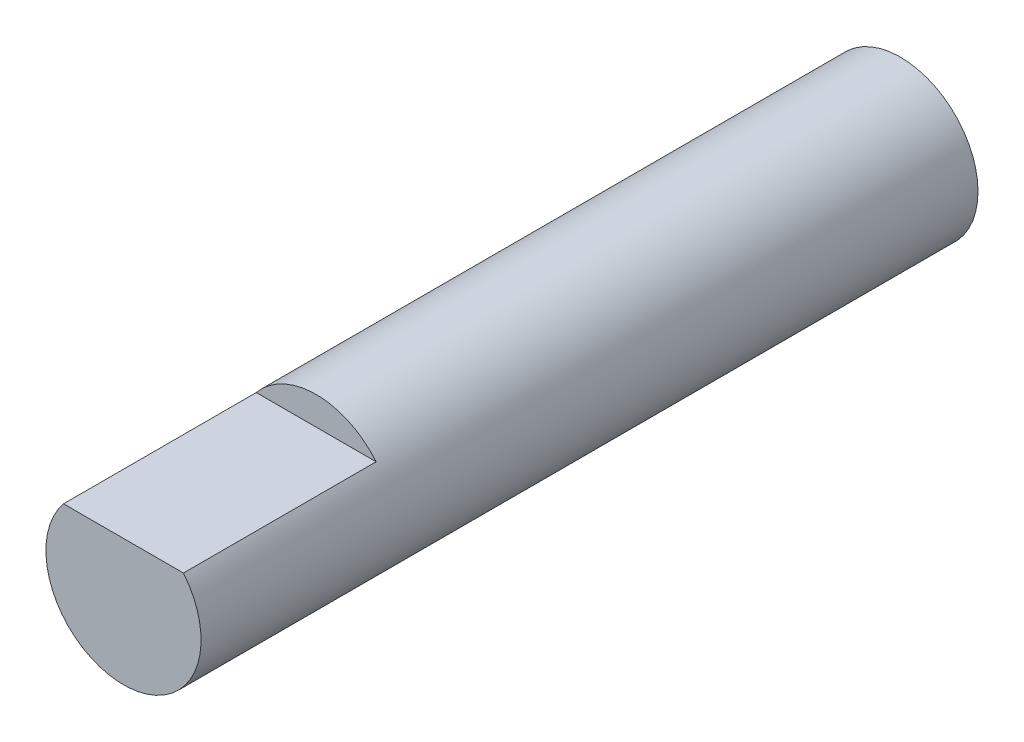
ISO-10303-21;
HEADER;
FILE_DESCRIPTION(('STEP AP214'),'2;1');
FILE_NAME('part.step','',(''),(''),'','','');
FILE_SCHEMA(('AUTOMOTIVE_DESIGN { 1 0 10303 214 1 1 1 1 }'));
ENDSEC;
DATA;
#1=APPLICATION_CONTEXT('core data for automotive mechanical design processes');
#2=APPLICATION_PROTOCOL_DEFINITION('international standard','automotive_design',2000,#1);
#3=PRODUCT_CONTEXT('',#1,'mechanical');
#4=PRODUCT('Part','Part','',(#3));
#5=PRODUCT_RELATED_PRODUCT_CATEGORY('part','',(#4));
#6=PRODUCT_DEFINITION_FORMATION('','',#4);
#7=PRODUCT_DEFINITION_CONTEXT('part definition',#1,'design');
#8=PRODUCT_DEFINITION('design','',#6,#7);
#9=PRODUCT_DEFINITION_SHAPE('','',#8);
#10=(LENGTH_UNIT() NAMED_UNIT(*) SI_UNIT(.MILLI.,.METRE.));
#11=(NAMED_UNIT(*) PLANE_ANGLE_UNIT() SI_UNIT($,.RADIAN.));
#12=(NAMED_UNIT(*) SI_UNIT($,.STERADIAN.) SOLID_ANGLE_UNIT());
#13=UNCERTAINTY_MEASURE_WITH_UNIT(LENGTH_MEASURE(1.E-05),#10,'distance_accuracy_value','');
#14=(GEOMETRIC_REPRESENTATION_CONTEXT(3) GLOBAL_UNCERTAINTY_ASSIGNED_CONTEXT((#13)) GLOBAL_UNIT_ASSIGNED_CONTEXT((#10,
#11,#12)) REPRESENTATION_CONTEXT('',''));
#15=CARTESIAN_POINT('',(0.,0.,0.));
#16=DIRECTION('',(0.,0.,1.));
#17=DIRECTION('',(1.,0.,0.));
#18=AXIS2_PLACEMENT_3D('',#15,#16,#17);
#19=CARTESIAN_POINT('',(0.,0.,31.75));
#20=DIRECTION('',(0.,0.,-1.));
#21=DIRECTION('',(-1.,0.,0.));
#22=AXIS2_PLACEMENT_3D('',#19,#20,#21);
#23=CYLINDRICAL_SURFACE('',#22,3.16992);
#24=CARTESIAN_POINT('',(0.,0.,31.75));
#25=DIRECTION('',(0.,0.,1.));
#26=DIRECTION('',(1.,0.,0.));
#27=AXIS2_PLACEMENT_3D('',#24,#25,#26);
#28=CIRCLE('',#27,3.16992);
#29=CARTESIAN_POINT('',(-2.44980333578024,2.01168,31.75));
#30=VERTEX_POINT('',#29);
#31=CARTESIAN_POINT('',(2.44980333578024,2.01168,31.75));
#32=VERTEX_POINT('',#31);
#33=EDGE_CURVE('E11',#30,#32,#28,.T.);
#34=ORIENTED_EDGE('',*,*,#33,.F.);
#35=DIRECTION('',(0.,0.,1.));
#36=VECTOR('',#35,1.);
#37=CARTESIAN_POINT('',(-2.44980333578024,2.01168,23.876));
#38=LINE('',#37,#36);
#39=CARTESIAN_POINT('',(-2.44980333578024,2.01168,23.876));
#40=VERTEX_POINT('',#39);
#41=EDGE_CURVE('E45',#40,#30,#38,.T.);
#42=ORIENTED_EDGE('',*,*,#41,.F.);
#43=CARTESIAN_POINT('',(0.,0.,23.876));
#44=DIRECTION('',(0.,0.,1.));
#45=DIRECTION('',(1.,0.,0.));
#46=AXIS2_PLACEMENT_3D('',#43,#44,#45);
#47=CIRCLE('',#46,3.16992);
#48=CARTESIAN_POINT('',(2.44980333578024,2.01168,23.876));
#49=VERTEX_POINT('',#48);
#50=EDGE_CURVE('E60',#49,#40,#47,.T.);
#51=ORIENTED_EDGE('',*,*,#50,.F.);
#52=DIRECTION('',(0.,0.,1.));
#53=VECTOR('',#52,1.);
#54=CARTESIAN_POINT('',(2.44980333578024,2.01168,23.876));
#55=LINE('',#54,#53);
#56=EDGE_CURVE('E50',#49,#32,#55,.T.);
#57=ORIENTED_EDGE('',*,*,#56,.T.);
#58=EDGE_LOOP('',(#34,#42,#51,#57));
#59=FACE_BOUND('',#58,.T.);
#60=CARTESIAN_POINT('',(0.,0.,0.));
#61=DIRECTION('',(0.,0.,1.));
#62=DIRECTION('',(1.,0.,0.));
#63=AXIS2_PLACEMENT_3D('',#60,#61,#62);
#64=CIRCLE('',#63,3.16992);
#65=CARTESIAN_POINT('',(3.16992,0.,0.));
#66=VERTEX_POINT('',#65);
#67=EDGE_CURVE('E38',#66,#66,#64,.T.);
#68=ORIENTED_EDGE('',*,*,#67,.T.);
#69=EDGE_LOOP('',(#68));
#70=FACE_BOUND('',#69,.T.);
#71=ADVANCED_FACE('F31',(#59,#70),#23,.T.);
#72=CARTESIAN_POINT('',(0.,0.,31.75));
#73=DIRECTION('',(0.,0.,1.));
#74=DIRECTION('',(1.,0.,0.));
#75=AXIS2_PLACEMENT_3D('',#72,#73,#74);
#76=PLANE('',#75);
#77=DIRECTION('',(1.,0.,0.));
#78=VECTOR('',#77,1.);
#79=CARTESIAN_POINT('',(-2.44980333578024,2.01168,31.75));
#80=LINE('',#79,#78);
#81=EDGE_CURVE('E56',#30,#32,#80,.T.);
#82=ORIENTED_EDGE('',*,*,#81,.F.);
#83=ORIENTED_EDGE('',*,*,#33,.T.);
#84=EDGE_LOOP('',(#82,#83));
#85=FACE_BOUND('',#84,.T.);
#86=ADVANCED_FACE('F66',(#85),#76,.T.);
#87=CARTESIAN_POINT('',(0.,0.,0.));
#88=DIRECTION('',(0.,0.,1.));
#89=DIRECTION('',(1.,0.,0.));
#90=AXIS2_PLACEMENT_3D('',#87,#88,#89);
#91=PLANE('',#90);
#92=ORIENTED_EDGE('',*,*,#67,.F.);
#93=EDGE_LOOP('',(#92));
#94=FACE_BOUND('',#93,.T.);
#95=ADVANCED_FACE('F68',(#94),#91,.F.);
#96=CARTESIAN_POINT('',(-2.44980333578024,2.01168,23.876));
#97=DIRECTION('',(0.,-1.,0.));
#98=DIRECTION('',(0.,0.,-1.));
#99=AXIS2_PLACEMENT_3D('',#96,#97,#98);
#100=PLANE('',#99);
#101=ORIENTED_EDGE('',*,*,#81,.T.);
#102=ORIENTED_EDGE('',*,*,#56,.F.);
#103=DIRECTION('',(1.,0.,0.));
#104=VECTOR('',#103,1.);
#105=CARTESIAN_POINT('',(-2.44980333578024,2.01168,23.876));
#106=LINE('',#105,#104);
#107=EDGE_CURVE('E83',#40,#49,#106,.T.);
#108=ORIENTED_EDGE('',*,*,#107,.F.);
#109=ORIENTED_EDGE('',*,*,#41,.T.);
#110=EDGE_LOOP('',(#101,#102,#108,#109));
#111=FACE_BOUND('',#110,.T.);
#112=ADVANCED_FACE('F57',(#111),#100,.F.);
#113=CARTESIAN_POINT('',(0.,0.,23.876));
#114=DIRECTION('',(0.,0.,1.));
#115=DIRECTION('',(1.,0.,0.));
#116=AXIS2_PLACEMENT_3D('',#113,#114,#115);
#117=PLANE('',#116);
#118=ORIENTED_EDGE('',*,*,#50,.T.);
#119=ORIENTED_EDGE('',*,*,#107,.T.);
#120=EDGE_LOOP('',(#118,#119));
#121=FACE_BOUND('',#120,.T.);
#122=ADVANCED_FACE('F78',(#121),#117,.T.);
#123=CLOSED_SHELL('',(#71,#86,#95,#112,#122));
#124=MANIFOLD_SOLID_BREP('B2',#123);
#125=ADVANCED_BREP_SHAPE_REPRESENTATION('',(#18,#124),#14);
#126=SHAPE_DEFINITION_REPRESENTATION(#9,#125);
ENDSEC;
END-ISO-10303-21;
